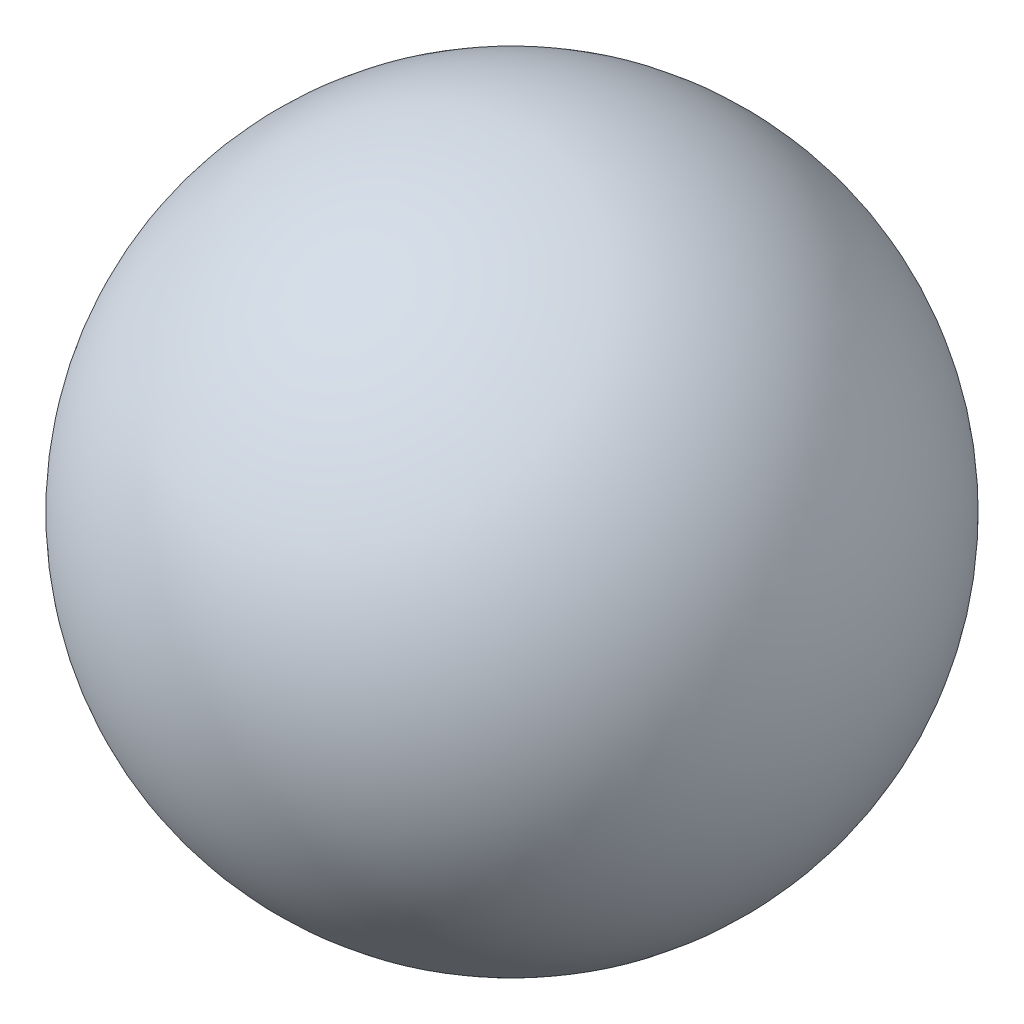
from build123d import *


with BuildPart() as part:
    # Sketch1 → Revolve-Thin1 (revolve)
    with BuildSketch(Plane.XY):
        with BuildLine():
            ThreePointArc((0, 12.7), (-12.7, 0), (0, -12.7))
            Line((0, -12.7), (0, -15.24))
            ThreePointArc((0, -15.24), (-15.24, 0), (0, 15.24))
            Line((0, 15.24), (0, 12.7))
        make_face()
    revolve(axis=Axis((0, -17.4625, 0), (0, 1, 0)))


solid = part.part
